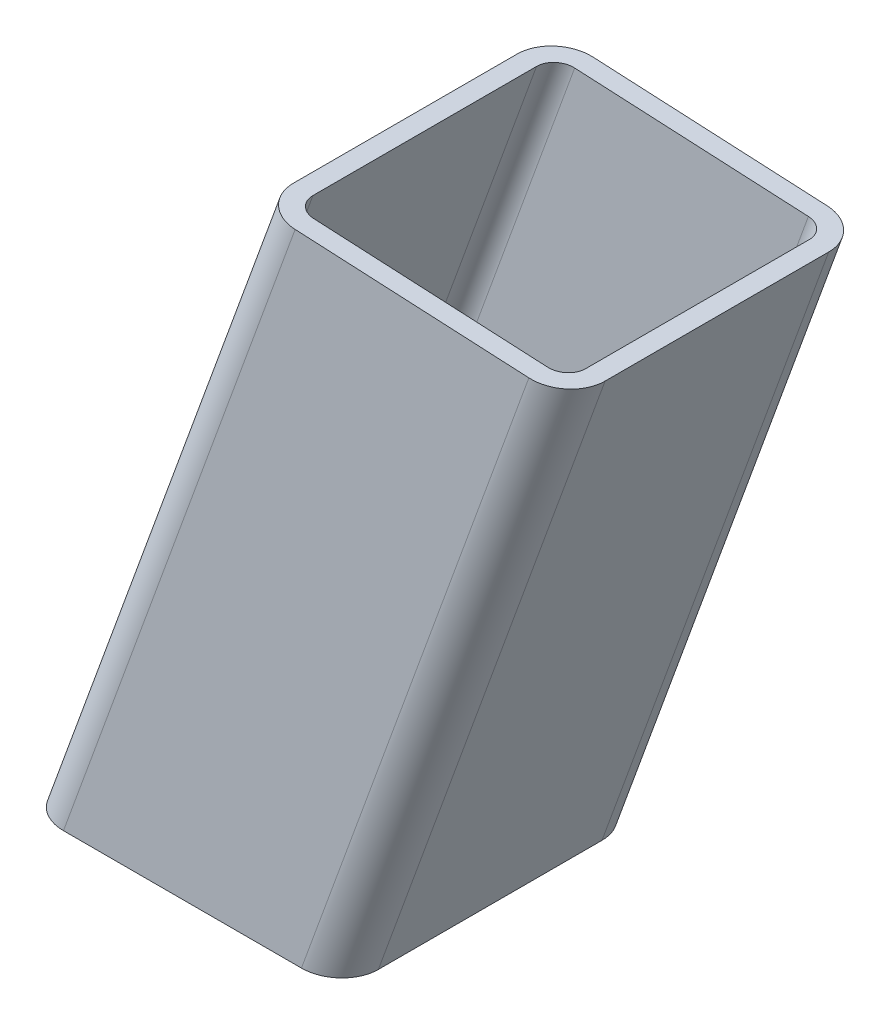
ISO-10303-21;
HEADER;
FILE_DESCRIPTION(('STEP AP214'),'2;1');
FILE_NAME('part.step','',(''),(''),'','','');
FILE_SCHEMA(('AUTOMOTIVE_DESIGN { 1 0 10303 214 1 1 1 1 }'));
ENDSEC;
DATA;
#1=APPLICATION_CONTEXT('core data for automotive mechanical design processes');
#2=APPLICATION_PROTOCOL_DEFINITION('international standard','automotive_design',2000,#1);
#3=PRODUCT_CONTEXT('',#1,'mechanical');
#4=PRODUCT('Part','Part','',(#3));
#5=PRODUCT_RELATED_PRODUCT_CATEGORY('part','',(#4));
#6=PRODUCT_DEFINITION_FORMATION('','',#4);
#7=PRODUCT_DEFINITION_CONTEXT('part definition',#1,'design');
#8=PRODUCT_DEFINITION('design','',#6,#7);
#9=PRODUCT_DEFINITION_SHAPE('','',#8);
#10=(LENGTH_UNIT() NAMED_UNIT(*) SI_UNIT(.MILLI.,.METRE.));
#11=(NAMED_UNIT(*) PLANE_ANGLE_UNIT() SI_UNIT($,.RADIAN.));
#12=(NAMED_UNIT(*) SI_UNIT($,.STERADIAN.) SOLID_ANGLE_UNIT());
#13=UNCERTAINTY_MEASURE_WITH_UNIT(LENGTH_MEASURE(1.E-05),#10,'distance_accuracy_value','');
#14=(GEOMETRIC_REPRESENTATION_CONTEXT(3) GLOBAL_UNCERTAINTY_ASSIGNED_CONTEXT((#13)) GLOBAL_UNIT_ASSIGNED_CONTEXT((#10,
#11,#12)) REPRESENTATION_CONTEXT('',''));
#15=CARTESIAN_POINT('',(0.,0.,0.));
#16=DIRECTION('',(0.,0.,1.));
#17=DIRECTION('',(1.,0.,0.));
#18=AXIS2_PLACEMENT_3D('',#15,#16,#17);
#19=CARTESIAN_POINT('',(2759.53789586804,289.083445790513,30.));
#20=DIRECTION('',(0.93969262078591,-0.342020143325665,0.));
#21=DIRECTION('',(0.342020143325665,0.93969262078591,0.));
#22=AXIS2_PLACEMENT_3D('',#19,#20,#21);
#23=PLANE('',#22);
#24=DIRECTION('',(0.,0.,-1.));
#25=VECTOR('',#24,1.);
#26=CARTESIAN_POINT('',(2675.06642973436,56.9999999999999,29.999999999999));
#27=LINE('',#26,#25);
#28=CARTESIAN_POINT('',(2675.06642973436,57.,30.));
#29=VERTEX_POINT('',#28);
#30=CARTESIAN_POINT('',(2675.06642973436,57.0000000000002,-30.));
#31=VERTEX_POINT('',#30);
#32=EDGE_CURVE('E184',#29,#31,#27,.T.);
#33=ORIENTED_EDGE('',*,*,#32,.F.);
#34=DIRECTION('',(-0.342020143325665,-0.93969262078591,0.));
#35=VECTOR('',#34,1.);
#36=CARTESIAN_POINT('',(2759.53789586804,289.083445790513,30.));
#37=LINE('',#36,#35);
#38=CARTESIAN_POINT('',(2737.42512619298,228.32911042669,30.));
#39=VERTEX_POINT('',#38);
#40=EDGE_CURVE('E217',#39,#29,#37,.T.);
#41=ORIENTED_EDGE('',*,*,#40,.F.);
#42=DIRECTION('',(0.,0.,1.));
#43=VECTOR('',#42,1.);
#44=CARTESIAN_POINT('',(2737.42512619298,228.32911042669,30.));
#45=LINE('',#44,#43);
#46=CARTESIAN_POINT('',(2737.42512619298,228.32911042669,-30.));
#47=VERTEX_POINT('',#46);
#48=EDGE_CURVE('E227',#47,#39,#45,.T.);
#49=ORIENTED_EDGE('',*,*,#48,.F.);
#50=DIRECTION('',(-0.342020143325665,-0.93969262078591,0.));
#51=VECTOR('',#50,1.);
#52=CARTESIAN_POINT('',(2759.53789586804,289.083445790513,-30.));
#53=LINE('',#52,#51);
#54=EDGE_CURVE('E248',#47,#31,#53,.T.);
#55=ORIENTED_EDGE('',*,*,#54,.T.);
#56=EDGE_LOOP('',(#33,#41,#49,#55));
#57=FACE_BOUND('',#56,.T.);
#58=ADVANCED_FACE('F34',(#57),#23,.F.);
#59=CARTESIAN_POINT('',(2768.9348220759,285.663244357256,-30.));
#60=DIRECTION('',(-0.342020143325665,-0.93969262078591,0.));
#61=DIRECTION('',(0.93969262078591,-0.342020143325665,0.));
#62=AXIS2_PLACEMENT_3D('',#59,#60,#61);
#63=CYLINDRICAL_SURFACE('',#62,10.);
#64=CARTESIAN_POINT('',(2685.70820745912,57.0000000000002,-30.));
#65=DIRECTION('',(0.,-1.,0.));
#66=DIRECTION('',(-1.,0.,0.));
#67=AXIS2_PLACEMENT_3D('',#64,#65,#66);
#68=ELLIPSE('',#67,10.6417777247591,10.);
#69=CARTESIAN_POINT('',(2685.70820745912,57.0000000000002,-40.));
#70=VERTEX_POINT('',#69);
#71=EDGE_CURVE('E183',#31,#70,#68,.T.);
#72=ORIENTED_EDGE('',*,*,#71,.F.);
#73=ORIENTED_EDGE('',*,*,#54,.F.);
#74=CARTESIAN_POINT('',(2747.87644559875,227.805830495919,-30.));
#75=DIRECTION('',(0.0500056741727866,0.998748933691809,0.));
#76=DIRECTION('',(-0.998748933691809,0.0500056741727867,0.));
#77=AXIS2_PLACEMENT_3D('',#74,#75,#76);
#78=ELLIPSE('',#77,10.464411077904,10.);
#79=CARTESIAN_POINT('',(2747.87644559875,227.805830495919,-40.));
#80=VERTEX_POINT('',#79);
#81=EDGE_CURVE('E122',#80,#47,#78,.T.);
#82=ORIENTED_EDGE('',*,*,#81,.F.);
#83=DIRECTION('',(-0.342020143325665,-0.93969262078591,0.));
#84=VECTOR('',#83,1.);
#85=CARTESIAN_POINT('',(2768.9348220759,285.663244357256,-40.));
#86=LINE('',#85,#84);
#87=EDGE_CURVE('E245',#80,#70,#86,.T.);
#88=ORIENTED_EDGE('',*,*,#87,.T.);
#89=EDGE_LOOP('',(#72,#73,#82,#88));
#90=FACE_BOUND('',#89,.T.);
#91=ADVANCED_FACE('F308',(#90),#63,.T.);
#92=CARTESIAN_POINT('',(2825.31637932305,265.142035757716,-40.));
#93=DIRECTION('',(0.,0.,1.));
#94=DIRECTION('',(1.,0.,0.));
#95=AXIS2_PLACEMENT_3D('',#92,#93,#94);
#96=PLANE('',#95);
#97=DIRECTION('',(1.,0.,0.));
#98=VECTOR('',#97,1.);
#99=CARTESIAN_POINT('',(2825.31637932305,57.0000000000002,-40.));
#100=LINE('',#99,#98);
#101=CARTESIAN_POINT('',(2749.55887380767,57.0000000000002,-40.));
#102=VERTEX_POINT('',#101);
#103=EDGE_CURVE('E181',#70,#102,#100,.T.);
#104=ORIENTED_EDGE('',*,*,#103,.F.);
#105=ORIENTED_EDGE('',*,*,#87,.F.);
#106=DIRECTION('',(-0.998748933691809,0.0500056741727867,0.));
#107=VECTOR('',#106,1.);
#108=CARTESIAN_POINT('',(2823.25804919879,224.031600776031,-40.));
#109=LINE('',#108,#107);
#110=CARTESIAN_POINT('',(2810.58436203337,224.666150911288,-40.));
#111=VERTEX_POINT('',#110);
#112=EDGE_CURVE('E118',#111,#80,#109,.T.);
#113=ORIENTED_EDGE('',*,*,#112,.F.);
#114=DIRECTION('',(-0.342020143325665,-0.93969262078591,0.));
#115=VECTOR('',#114,1.);
#116=CARTESIAN_POINT('',(2825.31637932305,265.142035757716,-40.));
#117=LINE('',#116,#115);
#118=EDGE_CURVE('E242',#111,#102,#117,.T.);
#119=ORIENTED_EDGE('',*,*,#118,.T.);
#120=EDGE_LOOP('',(#104,#105,#113,#119));
#121=FACE_BOUND('',#120,.T.);
#122=ADVANCED_FACE('F306',(#121),#96,.F.);
#123=CARTESIAN_POINT('',(2825.31637932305,265.142035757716,-30.));
#124=DIRECTION('',(-0.342020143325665,-0.93969262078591,0.));
#125=DIRECTION('',(0.93969262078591,-0.342020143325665,0.));
#126=AXIS2_PLACEMENT_3D('',#123,#124,#125);
#127=CYLINDRICAL_SURFACE('',#126,10.);
#128=CARTESIAN_POINT('',(2749.55887380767,57.0000000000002,-30.));
#129=DIRECTION('',(0.,-1.,0.));
#130=DIRECTION('',(-1.,0.,0.));
#131=AXIS2_PLACEMENT_3D('',#128,#129,#130);
#132=ELLIPSE('',#131,10.6417777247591,10.);
#133=CARTESIAN_POINT('',(2760.20065153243,57.0000000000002,-30.));
#134=VERTEX_POINT('',#133);
#135=EDGE_CURVE('E179',#102,#134,#132,.T.);
#136=ORIENTED_EDGE('',*,*,#135,.F.);
#137=ORIENTED_EDGE('',*,*,#118,.F.);
#138=CARTESIAN_POINT('',(2810.58436203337,224.666150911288,-30.));
#139=DIRECTION('',(0.0500056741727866,0.998748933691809,0.));
#140=DIRECTION('',(-0.998748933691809,0.0500056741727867,0.));
#141=AXIS2_PLACEMENT_3D('',#138,#139,#140);
#142=ELLIPSE('',#141,10.4644110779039,10.);
#143=CARTESIAN_POINT('',(2821.03568143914,224.142870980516,-30.));
#144=VERTEX_POINT('',#143);
#145=EDGE_CURVE('E223',#144,#111,#142,.T.);
#146=ORIENTED_EDGE('',*,*,#145,.F.);
#147=DIRECTION('',(-0.342020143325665,-0.93969262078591,0.));
#148=VECTOR('',#147,1.);
#149=CARTESIAN_POINT('',(2834.71330553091,261.72183432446,-30.));
#150=LINE('',#149,#148);
#151=EDGE_CURVE('E239',#144,#134,#150,.T.);
#152=ORIENTED_EDGE('',*,*,#151,.T.);
#153=EDGE_LOOP('',(#136,#137,#146,#152));
#154=FACE_BOUND('',#153,.T.);
#155=ADVANCED_FACE('F301',(#154),#127,.T.);
#156=CARTESIAN_POINT('',(2834.71330553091,261.72183432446,-30.));
#157=DIRECTION('',(-0.93969262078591,0.342020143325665,0.));
#158=DIRECTION('',(-0.342020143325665,-0.93969262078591,0.));
#159=AXIS2_PLACEMENT_3D('',#156,#157,#158);
#160=PLANE('',#159);
#161=DIRECTION('',(0.,0.,1.));
#162=VECTOR('',#161,1.);
#163=CARTESIAN_POINT('',(2760.20065153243,57.0000000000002,-30.0000000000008));
#164=LINE('',#163,#162);
#165=CARTESIAN_POINT('',(2760.20065153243,56.9999999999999,30.));
#166=VERTEX_POINT('',#165);
#167=EDGE_CURVE('E173',#134,#166,#164,.T.);
#168=ORIENTED_EDGE('',*,*,#167,.F.);
#169=ORIENTED_EDGE('',*,*,#151,.F.);
#170=DIRECTION('',(0.,0.,-1.));
#171=VECTOR('',#170,1.);
#172=CARTESIAN_POINT('',(2821.03568143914,224.142870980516,-30.));
#173=LINE('',#172,#171);
#174=CARTESIAN_POINT('',(2821.03568143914,224.142870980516,30.));
#175=VERTEX_POINT('',#174);
#176=EDGE_CURVE('E221',#175,#144,#173,.T.);
#177=ORIENTED_EDGE('',*,*,#176,.F.);
#178=DIRECTION('',(-0.342020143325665,-0.93969262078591,0.));
#179=VECTOR('',#178,1.);
#180=CARTESIAN_POINT('',(2834.71330553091,261.72183432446,30.));
#181=LINE('',#180,#179);
#182=EDGE_CURVE('E236',#175,#166,#181,.T.);
#183=ORIENTED_EDGE('',*,*,#182,.T.);
#184=EDGE_LOOP('',(#168,#169,#177,#183));
#185=FACE_BOUND('',#184,.T.);
#186=ADVANCED_FACE('F298',(#185),#160,.F.);
#187=CARTESIAN_POINT('',(2825.31637932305,265.142035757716,30.));
#188=DIRECTION('',(-0.342020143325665,-0.93969262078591,0.));
#189=DIRECTION('',(0.93969262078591,-0.342020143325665,0.));
#190=AXIS2_PLACEMENT_3D('',#187,#188,#189);
#191=CYLINDRICAL_SURFACE('',#190,10.);
#192=CARTESIAN_POINT('',(2749.55887380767,56.9999999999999,30.));
#193=DIRECTION('',(0.,-1.,0.));
#194=DIRECTION('',(-1.,0.,0.));
#195=AXIS2_PLACEMENT_3D('',#192,#193,#194);
#196=ELLIPSE('',#195,10.6417777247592,10.);
#197=CARTESIAN_POINT('',(2749.55887380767,56.9999999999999,40.));
#198=VERTEX_POINT('',#197);
#199=EDGE_CURVE('E171',#166,#198,#196,.T.);
#200=ORIENTED_EDGE('',*,*,#199,.F.);
#201=ORIENTED_EDGE('',*,*,#182,.F.);
#202=CARTESIAN_POINT('',(2810.58436203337,224.666150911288,30.));
#203=DIRECTION('',(0.0500056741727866,0.998748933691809,0.));
#204=DIRECTION('',(-0.998748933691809,0.0500056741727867,0.));
#205=AXIS2_PLACEMENT_3D('',#202,#203,#204);
#206=ELLIPSE('',#205,10.464411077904,10.);
#207=CARTESIAN_POINT('',(2810.58436203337,224.666150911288,40.));
#208=VERTEX_POINT('',#207);
#209=EDGE_CURVE('E219',#208,#175,#206,.T.);
#210=ORIENTED_EDGE('',*,*,#209,.F.);
#211=DIRECTION('',(-0.342020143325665,-0.93969262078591,0.));
#212=VECTOR('',#211,1.);
#213=CARTESIAN_POINT('',(2825.31637932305,265.142035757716,40.));
#214=LINE('',#213,#212);
#215=EDGE_CURVE('E233',#208,#198,#214,.T.);
#216=ORIENTED_EDGE('',*,*,#215,.T.);
#217=EDGE_LOOP('',(#200,#201,#210,#216));
#218=FACE_BOUND('',#217,.T.);
#219=ADVANCED_FACE('F291',(#218),#191,.T.);
#220=CARTESIAN_POINT('',(2768.9348220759,285.663244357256,40.));
#221=DIRECTION('',(0.,0.,-1.));
#222=DIRECTION('',(-1.,0.,0.));
#223=AXIS2_PLACEMENT_3D('',#220,#221,#222);
#224=PLANE('',#223);
#225=DIRECTION('',(-1.,0.,0.));
#226=VECTOR('',#225,1.);
#227=CARTESIAN_POINT('',(2768.9348220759,56.9999999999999,40.));
#228=LINE('',#227,#226);
#229=CARTESIAN_POINT('',(2685.70820745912,56.9999999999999,40.));
#230=VERTEX_POINT('',#229);
#231=EDGE_CURVE('E53',#198,#230,#228,.T.);
#232=ORIENTED_EDGE('',*,*,#231,.F.);
#233=ORIENTED_EDGE('',*,*,#215,.F.);
#234=DIRECTION('',(0.998748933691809,-0.0500056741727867,0.));
#235=VECTOR('',#234,1.);
#236=CARTESIAN_POINT('',(2765.99258478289,226.898785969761,40.));
#237=LINE('',#236,#235);
#238=CARTESIAN_POINT('',(2747.87644559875,227.805830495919,40.));
#239=VERTEX_POINT('',#238);
#240=EDGE_CURVE('E216',#239,#208,#237,.T.);
#241=ORIENTED_EDGE('',*,*,#240,.F.);
#242=DIRECTION('',(-0.342020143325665,-0.93969262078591,0.));
#243=VECTOR('',#242,1.);
#244=CARTESIAN_POINT('',(2768.9348220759,285.663244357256,40.));
#245=LINE('',#244,#243);
#246=EDGE_CURVE('E230',#239,#230,#245,.T.);
#247=ORIENTED_EDGE('',*,*,#246,.T.);
#248=EDGE_LOOP('',(#232,#233,#241,#247));
#249=FACE_BOUND('',#248,.T.);
#250=ADVANCED_FACE('F288',(#249),#224,.F.);
#251=CARTESIAN_POINT('',(2768.9348220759,285.663244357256,30.));
#252=DIRECTION('',(-0.342020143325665,-0.93969262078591,0.));
#253=DIRECTION('',(0.93969262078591,-0.342020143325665,0.));
#254=AXIS2_PLACEMENT_3D('',#251,#252,#253);
#255=CYLINDRICAL_SURFACE('',#254,10.);
#256=CARTESIAN_POINT('',(2685.70820745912,56.9999999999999,30.));
#257=DIRECTION('',(0.,-1.,0.));
#258=DIRECTION('',(-1.,0.,0.));
#259=AXIS2_PLACEMENT_3D('',#256,#257,#258);
#260=ELLIPSE('',#259,10.6417777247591,10.);
#261=EDGE_CURVE('E176',#230,#29,#260,.T.);
#262=ORIENTED_EDGE('',*,*,#261,.F.);
#263=ORIENTED_EDGE('',*,*,#246,.F.);
#264=CARTESIAN_POINT('',(2747.87644559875,227.805830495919,30.));
#265=DIRECTION('',(0.0500056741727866,0.998748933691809,0.));
#266=DIRECTION('',(-0.998748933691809,0.0500056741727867,0.));
#267=AXIS2_PLACEMENT_3D('',#264,#265,#266);
#268=ELLIPSE('',#267,10.464411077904,10.);
#269=EDGE_CURVE('E214',#39,#239,#268,.T.);
#270=ORIENTED_EDGE('',*,*,#269,.F.);
#271=ORIENTED_EDGE('',*,*,#40,.T.);
#272=EDGE_LOOP('',(#262,#263,#270,#271));
#273=FACE_BOUND('',#272,.T.);
#274=ADVANCED_FACE('F36',(#273),#255,.T.);
#275=CARTESIAN_POINT('',(6158.08276398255,57.0625533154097,-40.));
#276=DIRECTION('',(0.0500056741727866,0.998748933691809,0.));
#277=DIRECTION('',(-0.998748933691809,0.0500056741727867,0.));
#278=AXIS2_PLACEMENT_3D('',#275,#276,#277);
#279=PLANE('',#278);
#280=DIRECTION('',(0.998748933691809,-0.0500056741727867,0.));
#281=VECTOR('',#280,1.);
#282=CARTESIAN_POINT('',(2765.99258478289,226.898785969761,35.));
#283=LINE('',#282,#281);
#284=CARTESIAN_POINT('',(2747.87644559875,227.805830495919,35.));
#285=VERTEX_POINT('',#284);
#286=CARTESIAN_POINT('',(2810.58436203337,224.666150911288,35.));
#287=VERTEX_POINT('',#286);
#288=EDGE_CURVE('E186',#285,#287,#283,.T.);
#289=ORIENTED_EDGE('',*,*,#288,.F.);
#290=CARTESIAN_POINT('',(2747.87644559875,227.805830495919,30.));
#291=DIRECTION('',(0.0500056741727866,0.998748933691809,0.));
#292=DIRECTION('',(-0.998748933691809,0.0500056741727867,0.));
#293=AXIS2_PLACEMENT_3D('',#290,#291,#292);
#294=ELLIPSE('',#293,5.23220553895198,5.00000000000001);
#295=CARTESIAN_POINT('',(2742.65078589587,228.067470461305,30.));
#296=VERTEX_POINT('',#295);
#297=EDGE_CURVE('E191',#296,#285,#294,.T.);
#298=ORIENTED_EDGE('',*,*,#297,.F.);
#299=DIRECTION('',(0.,0.,1.));
#300=VECTOR('',#299,1.);
#301=CARTESIAN_POINT('',(2742.65078589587,228.067470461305,30.));
#302=LINE('',#301,#300);
#303=CARTESIAN_POINT('',(2742.65078589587,228.067470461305,-30.));
#304=VERTEX_POINT('',#303);
#305=EDGE_CURVE('E196',#304,#296,#302,.T.);
#306=ORIENTED_EDGE('',*,*,#305,.F.);
#307=CARTESIAN_POINT('',(2747.87644559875,227.805830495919,-30.));
#308=DIRECTION('',(0.0500056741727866,0.998748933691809,0.));
#309=DIRECTION('',(-0.998748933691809,0.0500056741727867,0.));
#310=AXIS2_PLACEMENT_3D('',#307,#308,#309);
#311=ELLIPSE('',#310,5.23220553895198,5.00000000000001);
#312=CARTESIAN_POINT('',(2747.87644559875,227.805830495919,-35.));
#313=VERTEX_POINT('',#312);
#314=EDGE_CURVE('E201',#313,#304,#311,.T.);
#315=ORIENTED_EDGE('',*,*,#314,.F.);
#316=DIRECTION('',(-0.998748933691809,0.0500056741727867,0.));
#317=VECTOR('',#316,1.);
#318=CARTESIAN_POINT('',(2823.25804919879,224.031600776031,-35.));
#319=LINE('',#318,#317);
#320=CARTESIAN_POINT('',(2810.58436203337,224.666150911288,-35.));
#321=VERTEX_POINT('',#320);
#322=EDGE_CURVE('E206',#321,#313,#319,.T.);
#323=ORIENTED_EDGE('',*,*,#322,.F.);
#324=CARTESIAN_POINT('',(2810.58436203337,224.666150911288,-30.));
#325=DIRECTION('',(0.0500056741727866,0.998748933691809,0.));
#326=DIRECTION('',(-0.998748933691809,0.0500056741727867,0.));
#327=AXIS2_PLACEMENT_3D('',#324,#325,#326);
#328=ELLIPSE('',#327,5.23220553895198,5.00000000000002);
#329=CARTESIAN_POINT('',(2815.81002173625,224.404510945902,-30.));
#330=VERTEX_POINT('',#329);
#331=EDGE_CURVE('E167',#330,#321,#328,.T.);
#332=ORIENTED_EDGE('',*,*,#331,.F.);
#333=DIRECTION('',(0.,0.,-1.));
#334=VECTOR('',#333,1.);
#335=CARTESIAN_POINT('',(2815.81002173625,224.404510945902,-30.));
#336=LINE('',#335,#334);
#337=CARTESIAN_POINT('',(2815.81002173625,224.404510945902,30.));
#338=VERTEX_POINT('',#337);
#339=EDGE_CURVE('E158',#338,#330,#336,.T.);
#340=ORIENTED_EDGE('',*,*,#339,.F.);
#341=CARTESIAN_POINT('',(2810.58436203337,224.666150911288,30.));
#342=DIRECTION('',(0.0500056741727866,0.998748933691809,0.));
#343=DIRECTION('',(-0.998748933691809,0.0500056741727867,0.));
#344=AXIS2_PLACEMENT_3D('',#341,#342,#343);
#345=ELLIPSE('',#344,5.23220553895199,5.00000000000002);
#346=EDGE_CURVE('E11',#287,#338,#345,.T.);
#347=ORIENTED_EDGE('',*,*,#346,.F.);
#348=EDGE_LOOP('',(#289,#298,#306,#315,#323,#332,#340,#347));
#349=FACE_BOUND('',#348,.T.);
#350=ORIENTED_EDGE('',*,*,#269,.T.);
#351=ORIENTED_EDGE('',*,*,#240,.T.);
#352=ORIENTED_EDGE('',*,*,#209,.T.);
#353=ORIENTED_EDGE('',*,*,#176,.T.);
#354=ORIENTED_EDGE('',*,*,#145,.T.);
#355=ORIENTED_EDGE('',*,*,#112,.T.);
#356=ORIENTED_EDGE('',*,*,#81,.T.);
#357=ORIENTED_EDGE('',*,*,#48,.T.);
#358=EDGE_LOOP('',(#350,#351,#352,#353,#354,#355,#356,#357));
#359=FACE_BOUND('',#358,.T.);
#360=ADVANCED_FACE('F284',(#349,#359),#279,.T.);
#361=CARTESIAN_POINT('',(9149.96897120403,57.0000000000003,-59.9999999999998));
#362=DIRECTION('',(0.,-1.,0.));
#363=DIRECTION('',(0.,0.,-1.));
#364=AXIS2_PLACEMENT_3D('',#361,#362,#363);
#365=PLANE('',#364);
#366=DIRECTION('',(0.,0.,1.));
#367=VECTOR('',#366,1.);
#368=CARTESIAN_POINT('',(2754.87976267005,57.0000000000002,-30.0000000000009));
#369=LINE('',#368,#367);
#370=CARTESIAN_POINT('',(2754.87976267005,57.0000000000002,-30.));
#371=VERTEX_POINT('',#370);
#372=CARTESIAN_POINT('',(2754.87976267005,57.0000000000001,30.));
#373=VERTEX_POINT('',#372);
#374=EDGE_CURVE('E151',#371,#373,#369,.T.);
#375=ORIENTED_EDGE('',*,*,#374,.F.);
#376=CARTESIAN_POINT('',(2749.55887380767,57.0000000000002,-30.));
#377=DIRECTION('',(0.,-1.,0.));
#378=DIRECTION('',(-1.,0.,0.));
#379=AXIS2_PLACEMENT_3D('',#376,#377,#378);
#380=ELLIPSE('',#379,5.32088886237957,5.00000000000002);
#381=CARTESIAN_POINT('',(2749.55887380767,57.0000000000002,-35.));
#382=VERTEX_POINT('',#381);
#383=EDGE_CURVE('E147',#382,#371,#380,.T.);
#384=ORIENTED_EDGE('',*,*,#383,.F.);
#385=DIRECTION('',(1.,0.,0.));
#386=VECTOR('',#385,1.);
#387=CARTESIAN_POINT('',(2825.31637932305,57.0000000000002,-35.));
#388=LINE('',#387,#386);
#389=CARTESIAN_POINT('',(2685.70820745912,57.0000000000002,-35.));
#390=VERTEX_POINT('',#389);
#391=EDGE_CURVE('E210',#390,#382,#388,.T.);
#392=ORIENTED_EDGE('',*,*,#391,.F.);
#393=CARTESIAN_POINT('',(2685.70820745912,57.0000000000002,-30.));
#394=DIRECTION('',(0.,-1.,0.));
#395=DIRECTION('',(-1.,0.,0.));
#396=AXIS2_PLACEMENT_3D('',#393,#394,#395);
#397=ELLIPSE('',#396,5.32088886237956,5.00000000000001);
#398=CARTESIAN_POINT('',(2680.38731859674,57.0000000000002,-30.));
#399=VERTEX_POINT('',#398);
#400=EDGE_CURVE('E205',#399,#390,#397,.T.);
#401=ORIENTED_EDGE('',*,*,#400,.F.);
#402=DIRECTION('',(0.,0.,-1.));
#403=VECTOR('',#402,1.);
#404=CARTESIAN_POINT('',(2680.38731859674,56.9999999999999,29.999999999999));
#405=LINE('',#404,#403);
#406=CARTESIAN_POINT('',(2680.38731859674,56.9999999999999,30.));
#407=VERTEX_POINT('',#406);
#408=EDGE_CURVE('E200',#407,#399,#405,.T.);
#409=ORIENTED_EDGE('',*,*,#408,.F.);
#410=CARTESIAN_POINT('',(2685.70820745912,56.9999999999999,30.));
#411=DIRECTION('',(0.,-1.,0.));
#412=DIRECTION('',(-1.,0.,0.));
#413=AXIS2_PLACEMENT_3D('',#410,#411,#412);
#414=ELLIPSE('',#413,5.32088886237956,5.00000000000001);
#415=CARTESIAN_POINT('',(2685.70820745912,56.9999999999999,35.));
#416=VERTEX_POINT('',#415);
#417=EDGE_CURVE('E195',#416,#407,#414,.T.);
#418=ORIENTED_EDGE('',*,*,#417,.F.);
#419=DIRECTION('',(-1.,0.,0.));
#420=VECTOR('',#419,1.);
#421=CARTESIAN_POINT('',(2768.9348220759,56.9999999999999,35.));
#422=LINE('',#421,#420);
#423=CARTESIAN_POINT('',(2749.55887380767,56.9999999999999,35.));
#424=VERTEX_POINT('',#423);
#425=EDGE_CURVE('E190',#424,#416,#422,.T.);
#426=ORIENTED_EDGE('',*,*,#425,.F.);
#427=CARTESIAN_POINT('',(2749.55887380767,56.9999999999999,30.));
#428=DIRECTION('',(0.,-1.,0.));
#429=DIRECTION('',(-1.,0.,0.));
#430=AXIS2_PLACEMENT_3D('',#427,#428,#429);
#431=ELLIPSE('',#430,5.32088886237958,5.00000000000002);
#432=EDGE_CURVE('E44',#373,#424,#431,.T.);
#433=ORIENTED_EDGE('',*,*,#432,.F.);
#434=EDGE_LOOP('',(#375,#384,#392,#401,#409,#418,#426,#433));
#435=FACE_BOUND('',#434,.T.);
#436=ORIENTED_EDGE('',*,*,#261,.T.);
#437=ORIENTED_EDGE('',*,*,#32,.T.);
#438=ORIENTED_EDGE('',*,*,#71,.T.);
#439=ORIENTED_EDGE('',*,*,#103,.T.);
#440=ORIENTED_EDGE('',*,*,#135,.T.);
#441=ORIENTED_EDGE('',*,*,#167,.T.);
#442=ORIENTED_EDGE('',*,*,#199,.T.);
#443=ORIENTED_EDGE('',*,*,#231,.T.);
#444=EDGE_LOOP('',(#436,#437,#438,#439,#440,#441,#442,#443));
#445=FACE_BOUND('',#444,.T.);
#446=ADVANCED_FACE('F152',(#435,#445),#365,.T.);
#447=CARTESIAN_POINT('',(2830.01484242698,263.431935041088,-30.));
#448=DIRECTION('',(-0.93969262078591,0.342020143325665,0.));
#449=DIRECTION('',(-0.342020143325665,-0.93969262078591,0.));
#450=AXIS2_PLACEMENT_3D('',#447,#448,#449);
#451=PLANE('',#450);
#452=DIRECTION('',(-0.342020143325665,-0.93969262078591,0.));
#453=VECTOR('',#452,1.);
#454=CARTESIAN_POINT('',(2830.01484242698,263.431935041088,-30.));
#455=LINE('',#454,#453);
#456=EDGE_CURVE('E38',#330,#371,#455,.T.);
#457=ORIENTED_EDGE('',*,*,#456,.T.);
#458=ORIENTED_EDGE('',*,*,#374,.T.);
#459=DIRECTION('',(-0.342020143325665,-0.93969262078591,0.));
#460=VECTOR('',#459,1.);
#461=CARTESIAN_POINT('',(2830.01484242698,263.431935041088,30.));
#462=LINE('',#461,#460);
#463=EDGE_CURVE('E189',#338,#373,#462,.T.);
#464=ORIENTED_EDGE('',*,*,#463,.F.);
#465=ORIENTED_EDGE('',*,*,#339,.T.);
#466=EDGE_LOOP('',(#457,#458,#464,#465));
#467=FACE_BOUND('',#466,.T.);
#468=ADVANCED_FACE('F170',(#467),#451,.T.);
#469=CARTESIAN_POINT('',(2825.31637932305,265.142035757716,-30.));
#470=DIRECTION('',(-0.342020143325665,-0.93969262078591,0.));
#471=DIRECTION('',(0.93969262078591,-0.342020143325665,0.));
#472=AXIS2_PLACEMENT_3D('',#469,#470,#471);
#473=CYLINDRICAL_SURFACE('',#472,5.00000000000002);
#474=DIRECTION('',(-0.342020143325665,-0.93969262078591,0.));
#475=VECTOR('',#474,1.);
#476=CARTESIAN_POINT('',(2825.31637932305,265.142035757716,-35.));
#477=LINE('',#476,#475);
#478=EDGE_CURVE('E166',#321,#382,#477,.T.);
#479=ORIENTED_EDGE('',*,*,#478,.T.);
#480=ORIENTED_EDGE('',*,*,#383,.T.);
#481=ORIENTED_EDGE('',*,*,#456,.F.);
#482=ORIENTED_EDGE('',*,*,#331,.T.);
#483=EDGE_LOOP('',(#479,#480,#481,#482));
#484=FACE_BOUND('',#483,.T.);
#485=ADVANCED_FACE('F163',(#484),#473,.F.);
#486=CARTESIAN_POINT('',(2825.31637932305,265.142035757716,-35.));
#487=DIRECTION('',(0.,0.,1.));
#488=DIRECTION('',(1.,0.,0.));
#489=AXIS2_PLACEMENT_3D('',#486,#487,#488);
#490=PLANE('',#489);
#491=DIRECTION('',(-0.342020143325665,-0.93969262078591,0.));
#492=VECTOR('',#491,1.);
#493=CARTESIAN_POINT('',(2768.9348220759,285.663244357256,-35.));
#494=LINE('',#493,#492);
#495=EDGE_CURVE('E212',#313,#390,#494,.T.);
#496=ORIENTED_EDGE('',*,*,#495,.T.);
#497=ORIENTED_EDGE('',*,*,#391,.T.);
#498=ORIENTED_EDGE('',*,*,#478,.F.);
#499=ORIENTED_EDGE('',*,*,#322,.T.);
#500=EDGE_LOOP('',(#496,#497,#498,#499));
#501=FACE_BOUND('',#500,.T.);
#502=ADVANCED_FACE('F342',(#501),#490,.T.);
#503=CARTESIAN_POINT('',(2768.9348220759,285.663244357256,-30.));
#504=DIRECTION('',(-0.342020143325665,-0.93969262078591,0.));
#505=DIRECTION('',(0.93969262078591,-0.342020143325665,0.));
#506=AXIS2_PLACEMENT_3D('',#503,#504,#505);
#507=CYLINDRICAL_SURFACE('',#506,5.00000000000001);
#508=DIRECTION('',(-0.342020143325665,-0.93969262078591,0.));
#509=VECTOR('',#508,1.);
#510=CARTESIAN_POINT('',(2764.23635897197,287.373345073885,-30.));
#511=LINE('',#510,#509);
#512=EDGE_CURVE('E209',#304,#399,#511,.T.);
#513=ORIENTED_EDGE('',*,*,#512,.T.);
#514=ORIENTED_EDGE('',*,*,#400,.T.);
#515=ORIENTED_EDGE('',*,*,#495,.F.);
#516=ORIENTED_EDGE('',*,*,#314,.T.);
#517=EDGE_LOOP('',(#513,#514,#515,#516));
#518=FACE_BOUND('',#517,.T.);
#519=ADVANCED_FACE('F345',(#518),#507,.F.);
#520=CARTESIAN_POINT('',(2764.23635897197,287.373345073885,30.));
#521=DIRECTION('',(0.93969262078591,-0.342020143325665,0.));
#522=DIRECTION('',(0.342020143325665,0.93969262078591,0.));
#523=AXIS2_PLACEMENT_3D('',#520,#521,#522);
#524=PLANE('',#523);
#525=DIRECTION('',(-0.342020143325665,-0.93969262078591,0.));
#526=VECTOR('',#525,1.);
#527=CARTESIAN_POINT('',(2764.23635897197,287.373345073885,30.));
#528=LINE('',#527,#526);
#529=EDGE_CURVE('E204',#296,#407,#528,.T.);
#530=ORIENTED_EDGE('',*,*,#529,.T.);
#531=ORIENTED_EDGE('',*,*,#408,.T.);
#532=ORIENTED_EDGE('',*,*,#512,.F.);
#533=ORIENTED_EDGE('',*,*,#305,.T.);
#534=EDGE_LOOP('',(#530,#531,#532,#533));
#535=FACE_BOUND('',#534,.T.);
#536=ADVANCED_FACE('F348',(#535),#524,.T.);
#537=CARTESIAN_POINT('',(2768.9348220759,285.663244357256,30.));
#538=DIRECTION('',(-0.342020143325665,-0.93969262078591,0.));
#539=DIRECTION('',(0.93969262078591,-0.342020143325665,0.));
#540=AXIS2_PLACEMENT_3D('',#537,#538,#539);
#541=CYLINDRICAL_SURFACE('',#540,5.00000000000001);
#542=DIRECTION('',(-0.342020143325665,-0.93969262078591,0.));
#543=VECTOR('',#542,1.);
#544=CARTESIAN_POINT('',(2768.9348220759,285.663244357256,35.));
#545=LINE('',#544,#543);
#546=EDGE_CURVE('E199',#285,#416,#545,.T.);
#547=ORIENTED_EDGE('',*,*,#546,.T.);
#548=ORIENTED_EDGE('',*,*,#417,.T.);
#549=ORIENTED_EDGE('',*,*,#529,.F.);
#550=ORIENTED_EDGE('',*,*,#297,.T.);
#551=EDGE_LOOP('',(#547,#548,#549,#550));
#552=FACE_BOUND('',#551,.T.);
#553=ADVANCED_FACE('F352',(#552),#541,.F.);
#554=CARTESIAN_POINT('',(2768.9348220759,285.663244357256,35.));
#555=DIRECTION('',(0.,0.,-1.));
#556=DIRECTION('',(-1.,0.,0.));
#557=AXIS2_PLACEMENT_3D('',#554,#555,#556);
#558=PLANE('',#557);
#559=DIRECTION('',(-0.342020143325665,-0.93969262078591,0.));
#560=VECTOR('',#559,1.);
#561=CARTESIAN_POINT('',(2825.31637932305,265.142035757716,35.));
#562=LINE('',#561,#560);
#563=EDGE_CURVE('E194',#287,#424,#562,.T.);
#564=ORIENTED_EDGE('',*,*,#563,.T.);
#565=ORIENTED_EDGE('',*,*,#425,.T.);
#566=ORIENTED_EDGE('',*,*,#546,.F.);
#567=ORIENTED_EDGE('',*,*,#288,.T.);
#568=EDGE_LOOP('',(#564,#565,#566,#567));
#569=FACE_BOUND('',#568,.T.);
#570=ADVANCED_FACE('F356',(#569),#558,.T.);
#571=CARTESIAN_POINT('',(2825.31637932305,265.142035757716,30.));
#572=DIRECTION('',(-0.342020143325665,-0.93969262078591,0.));
#573=DIRECTION('',(0.93969262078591,-0.342020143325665,0.));
#574=AXIS2_PLACEMENT_3D('',#571,#572,#573);
#575=CYLINDRICAL_SURFACE('',#574,5.00000000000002);
#576=ORIENTED_EDGE('',*,*,#463,.T.);
#577=ORIENTED_EDGE('',*,*,#432,.T.);
#578=ORIENTED_EDGE('',*,*,#563,.F.);
#579=ORIENTED_EDGE('',*,*,#346,.T.);
#580=EDGE_LOOP('',(#576,#577,#578,#579));
#581=FACE_BOUND('',#580,.T.);
#582=ADVANCED_FACE('F359',(#581),#575,.F.);
#583=CLOSED_SHELL('',(#58,#91,#122,#155,#186,#219,#250,#274,#360,#446,#468,#485,#502,#519,#536,
#553,#570,#582));
#584=MANIFOLD_SOLID_BREP('B2',#583);
#585=ADVANCED_BREP_SHAPE_REPRESENTATION('',(#18,#584),#14);
#586=SHAPE_DEFINITION_REPRESENTATION(#9,#585);
ENDSEC;
END-ISO-10303-21;
